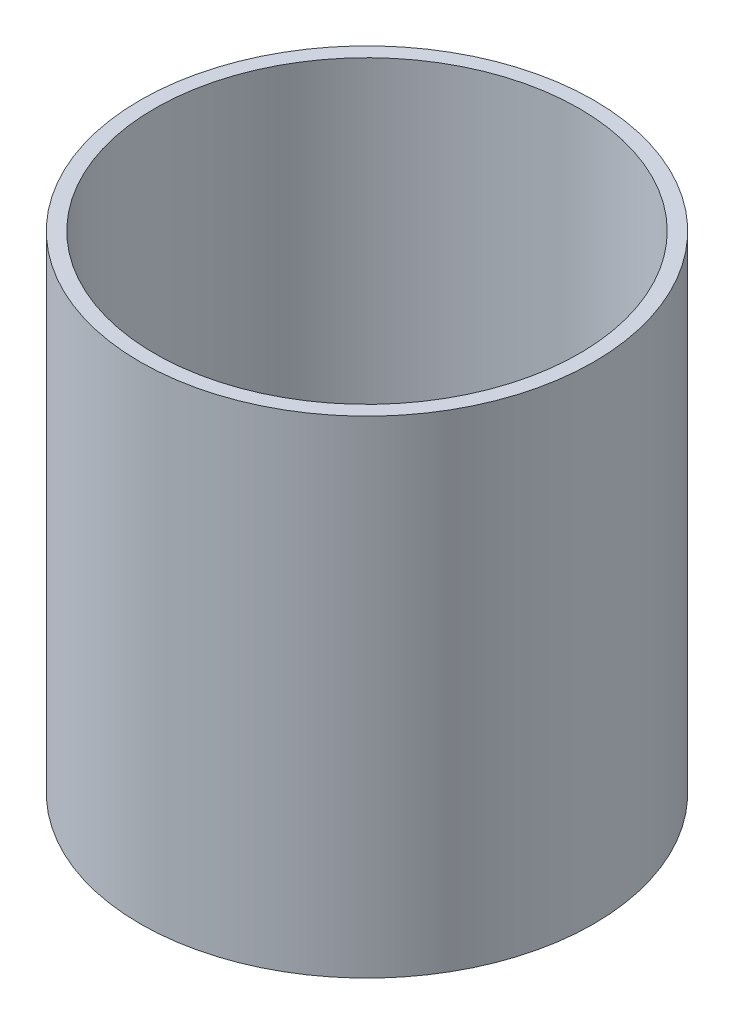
from build123d import *

# Parameters (mm, degrees)
SKETCH1_R          = 20.8915
EXTRUDE1_DEPTH     = 44.831
SKETCH2_R          = 19.558
CUT_EXTRUDE1_DEPTH = 54.691043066


with BuildPart() as part:
    # Sketch1 → Extrude1 (new body)
    with BuildSketch(Plane(origin=(0, 0, 0), x_dir=(1, 0, 0), z_dir=(0, 1, 0))):
        with Locations(Location((0, 0, 0), (0, 0, 90))):
            Circle(SKETCH1_R)
    extrude(amount=EXTRUDE1_DEPTH)

    # Sketch2 → Cut-Extrude1 (cut, through all)
    with BuildSketch(Plane.XZ):
        with Locations(Location((0, 0, 0), (0, 0, 270))):
            Circle(SKETCH2_R)
    extrude(amount=-CUT_EXTRUDE1_DEPTH, mode=Mode.SUBTRACT)


solid = part.part
